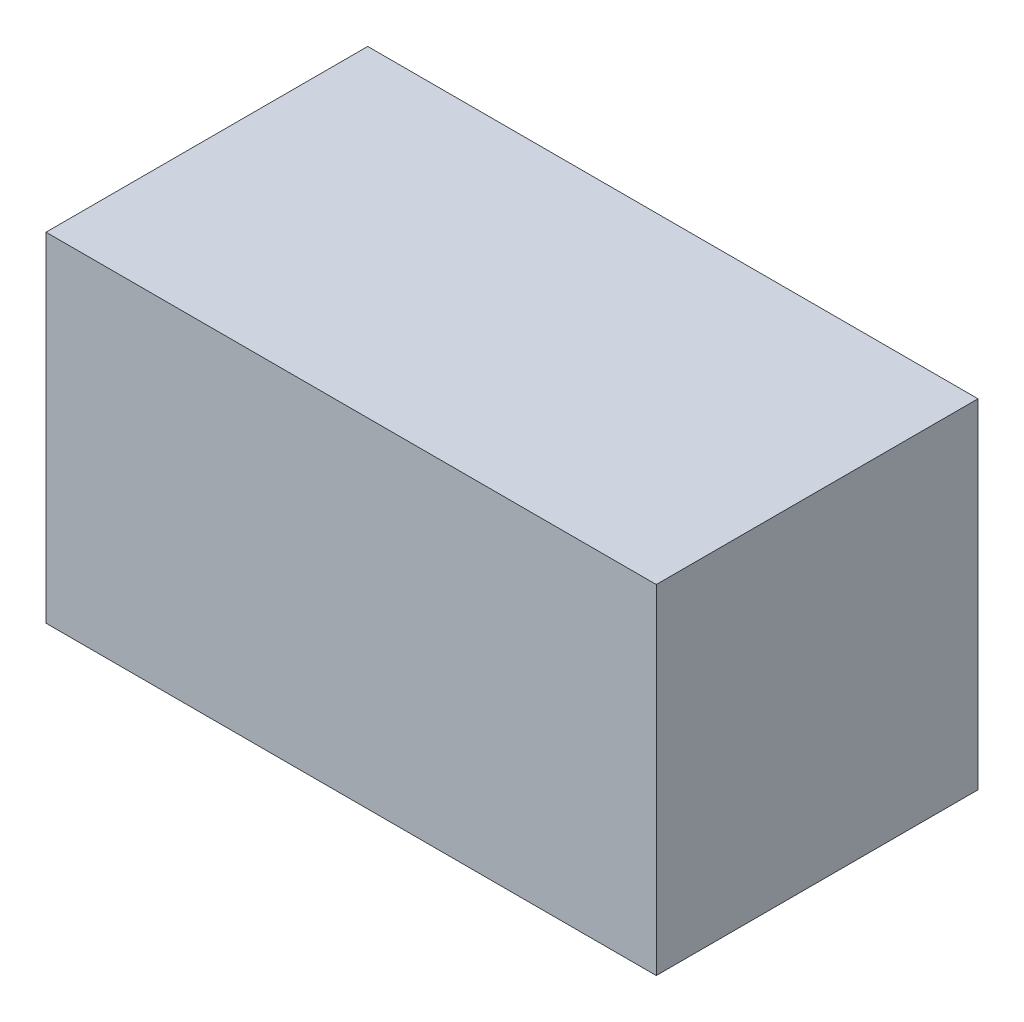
ISO-10303-21;
HEADER;
FILE_DESCRIPTION(('STEP AP214'),'2;1');
FILE_NAME('part.step','',(''),(''),'','','');
FILE_SCHEMA(('AUTOMOTIVE_DESIGN { 1 0 10303 214 1 1 1 1 }'));
ENDSEC;
DATA;
#1=APPLICATION_CONTEXT('core data for automotive mechanical design processes');
#2=APPLICATION_PROTOCOL_DEFINITION('international standard','automotive_design',2000,#1);
#3=PRODUCT_CONTEXT('',#1,'mechanical');
#4=PRODUCT('Part','Part','',(#3));
#5=PRODUCT_RELATED_PRODUCT_CATEGORY('part','',(#4));
#6=PRODUCT_DEFINITION_FORMATION('','',#4);
#7=PRODUCT_DEFINITION_CONTEXT('part definition',#1,'design');
#8=PRODUCT_DEFINITION('design','',#6,#7);
#9=PRODUCT_DEFINITION_SHAPE('','',#8);
#10=(LENGTH_UNIT() NAMED_UNIT(*) SI_UNIT(.MILLI.,.METRE.));
#11=(NAMED_UNIT(*) PLANE_ANGLE_UNIT() SI_UNIT($,.RADIAN.));
#12=(NAMED_UNIT(*) SI_UNIT($,.STERADIAN.) SOLID_ANGLE_UNIT());
#13=UNCERTAINTY_MEASURE_WITH_UNIT(LENGTH_MEASURE(1.E-05),#10,'distance_accuracy_value','');
#14=(GEOMETRIC_REPRESENTATION_CONTEXT(3) GLOBAL_UNCERTAINTY_ASSIGNED_CONTEXT((#13)) GLOBAL_UNIT_ASSIGNED_CONTEXT((#10,
#11,#12)) REPRESENTATION_CONTEXT('',''));
#15=CARTESIAN_POINT('',(0.,0.,0.));
#16=DIRECTION('',(0.,0.,1.));
#17=DIRECTION('',(1.,0.,0.));
#18=AXIS2_PLACEMENT_3D('',#15,#16,#17);
#19=CARTESIAN_POINT('',(0.,10.,0.));
#20=DIRECTION('',(1.,0.,0.));
#21=DIRECTION('',(0.,0.,-1.));
#22=AXIS2_PLACEMENT_3D('',#19,#20,#21);
#23=PLANE('',#22);
#24=DIRECTION('',(0.,0.,1.));
#25=VECTOR('',#24,1.);
#26=CARTESIAN_POINT('',(0.,0.,0.));
#27=LINE('',#26,#25);
#28=CARTESIAN_POINT('',(0.,0.,0.));
#29=VERTEX_POINT('',#28);
#30=CARTESIAN_POINT('',(0.,0.,9.5));
#31=VERTEX_POINT('',#30);
#32=EDGE_CURVE('E112',#29,#31,#27,.T.);
#33=ORIENTED_EDGE('',*,*,#32,.T.);
#34=DIRECTION('',(0.,-1.,0.));
#35=VECTOR('',#34,1.);
#36=CARTESIAN_POINT('',(0.,10.,9.5));
#37=LINE('',#36,#35);
#38=CARTESIAN_POINT('',(0.,10.,9.5));
#39=VERTEX_POINT('',#38);
#40=EDGE_CURVE('E11',#39,#31,#37,.T.);
#41=ORIENTED_EDGE('',*,*,#40,.F.);
#42=DIRECTION('',(0.,0.,1.));
#43=VECTOR('',#42,1.);
#44=CARTESIAN_POINT('',(0.,10.,0.));
#45=LINE('',#44,#43);
#46=CARTESIAN_POINT('',(0.,10.,0.));
#47=VERTEX_POINT('',#46);
#48=EDGE_CURVE('E96',#47,#39,#45,.T.);
#49=ORIENTED_EDGE('',*,*,#48,.F.);
#50=DIRECTION('',(0.,-1.,0.));
#51=VECTOR('',#50,1.);
#52=CARTESIAN_POINT('',(0.,10.,0.));
#53=LINE('',#52,#51);
#54=EDGE_CURVE('E108',#47,#29,#53,.T.);
#55=ORIENTED_EDGE('',*,*,#54,.T.);
#56=EDGE_LOOP('',(#33,#41,#49,#55));
#57=FACE_BOUND('',#56,.T.);
#58=ADVANCED_FACE('F44',(#57),#23,.F.);
#59=CARTESIAN_POINT('',(0.,10.,9.5));
#60=DIRECTION('',(0.,0.,-1.));
#61=DIRECTION('',(-1.,0.,0.));
#62=AXIS2_PLACEMENT_3D('',#59,#60,#61);
#63=PLANE('',#62);
#64=DIRECTION('',(1.,0.,0.));
#65=VECTOR('',#64,1.);
#66=CARTESIAN_POINT('',(0.,0.,9.5));
#67=LINE('',#66,#65);
#68=CARTESIAN_POINT('',(18.02,0.,9.5));
#69=VERTEX_POINT('',#68);
#70=EDGE_CURVE('E101',#31,#69,#67,.T.);
#71=ORIENTED_EDGE('',*,*,#70,.T.);
#72=DIRECTION('',(0.,-1.,0.));
#73=VECTOR('',#72,1.);
#74=CARTESIAN_POINT('',(18.02,10.,9.5));
#75=LINE('',#74,#73);
#76=CARTESIAN_POINT('',(18.02,10.,9.5));
#77=VERTEX_POINT('',#76);
#78=EDGE_CURVE('E53',#77,#69,#75,.T.);
#79=ORIENTED_EDGE('',*,*,#78,.F.);
#80=DIRECTION('',(1.,0.,0.));
#81=VECTOR('',#80,1.);
#82=CARTESIAN_POINT('',(0.,10.,9.5));
#83=LINE('',#82,#81);
#84=EDGE_CURVE('E91',#39,#77,#83,.T.);
#85=ORIENTED_EDGE('',*,*,#84,.F.);
#86=ORIENTED_EDGE('',*,*,#40,.T.);
#87=EDGE_LOOP('',(#71,#79,#85,#86));
#88=FACE_BOUND('',#87,.T.);
#89=ADVANCED_FACE('F100',(#88),#63,.F.);
#90=CARTESIAN_POINT('',(18.02,10.,0.));
#91=DIRECTION('',(-1.,0.,0.));
#92=DIRECTION('',(0.,0.,1.));
#93=AXIS2_PLACEMENT_3D('',#90,#91,#92);
#94=PLANE('',#93);
#95=DIRECTION('',(0.,0.,-1.));
#96=VECTOR('',#95,1.);
#97=CARTESIAN_POINT('',(18.02,0.,0.));
#98=LINE('',#97,#96);
#99=CARTESIAN_POINT('',(18.02,0.,0.));
#100=VERTEX_POINT('',#99);
#101=EDGE_CURVE('E78',#69,#100,#98,.T.);
#102=ORIENTED_EDGE('',*,*,#101,.T.);
#103=DIRECTION('',(0.,-1.,0.));
#104=VECTOR('',#103,1.);
#105=CARTESIAN_POINT('',(18.02,10.,0.));
#106=LINE('',#105,#104);
#107=CARTESIAN_POINT('',(18.02,10.,0.));
#108=VERTEX_POINT('',#107);
#109=EDGE_CURVE('E103',#108,#100,#106,.T.);
#110=ORIENTED_EDGE('',*,*,#109,.F.);
#111=DIRECTION('',(0.,0.,-1.));
#112=VECTOR('',#111,1.);
#113=CARTESIAN_POINT('',(18.02,10.,0.));
#114=LINE('',#113,#112);
#115=EDGE_CURVE('E94',#77,#108,#114,.T.);
#116=ORIENTED_EDGE('',*,*,#115,.F.);
#117=ORIENTED_EDGE('',*,*,#78,.T.);
#118=EDGE_LOOP('',(#102,#110,#116,#117));
#119=FACE_BOUND('',#118,.T.);
#120=ADVANCED_FACE('F104',(#119),#94,.F.);
#121=CARTESIAN_POINT('',(0.,10.,0.));
#122=DIRECTION('',(0.,0.,1.));
#123=DIRECTION('',(1.,0.,0.));
#124=AXIS2_PLACEMENT_3D('',#121,#122,#123);
#125=PLANE('',#124);
#126=DIRECTION('',(-1.,0.,0.));
#127=VECTOR('',#126,1.);
#128=CARTESIAN_POINT('',(0.,0.,0.));
#129=LINE('',#128,#127);
#130=EDGE_CURVE('E84',#100,#29,#129,.T.);
#131=ORIENTED_EDGE('',*,*,#130,.T.);
#132=ORIENTED_EDGE('',*,*,#54,.F.);
#133=DIRECTION('',(-1.,0.,0.));
#134=VECTOR('',#133,1.);
#135=CARTESIAN_POINT('',(0.,10.,0.));
#136=LINE('',#135,#134);
#137=EDGE_CURVE('E61',#108,#47,#136,.T.);
#138=ORIENTED_EDGE('',*,*,#137,.F.);
#139=ORIENTED_EDGE('',*,*,#109,.T.);
#140=EDGE_LOOP('',(#131,#132,#138,#139));
#141=FACE_BOUND('',#140,.T.);
#142=ADVANCED_FACE('F125',(#141),#125,.F.);
#143=CARTESIAN_POINT('',(0.,10.,0.));
#144=DIRECTION('',(0.,1.,0.));
#145=DIRECTION('',(0.,0.,1.));
#146=AXIS2_PLACEMENT_3D('',#143,#144,#145);
#147=PLANE('',#146);
#148=ORIENTED_EDGE('',*,*,#48,.T.);
#149=ORIENTED_EDGE('',*,*,#84,.T.);
#150=ORIENTED_EDGE('',*,*,#115,.T.);
#151=ORIENTED_EDGE('',*,*,#137,.T.);
#152=EDGE_LOOP('',(#148,#149,#150,#151));
#153=FACE_BOUND('',#152,.T.);
#154=ADVANCED_FACE('F92',(#153),#147,.T.);
#155=CARTESIAN_POINT('',(0.,0.,0.));
#156=DIRECTION('',(0.,1.,0.));
#157=DIRECTION('',(0.,0.,1.));
#158=AXIS2_PLACEMENT_3D('',#155,#156,#157);
#159=PLANE('',#158);
#160=ORIENTED_EDGE('',*,*,#32,.F.);
#161=ORIENTED_EDGE('',*,*,#130,.F.);
#162=ORIENTED_EDGE('',*,*,#101,.F.);
#163=ORIENTED_EDGE('',*,*,#70,.F.);
#164=EDGE_LOOP('',(#160,#161,#162,#163));
#165=FACE_BOUND('',#164,.T.);
#166=ADVANCED_FACE('F128',(#165),#159,.F.);
#167=CLOSED_SHELL('',(#58,#89,#120,#142,#154,#166));
#168=MANIFOLD_SOLID_BREP('B2',#167);
#169=ADVANCED_BREP_SHAPE_REPRESENTATION('',(#18,#168),#14);
#170=SHAPE_DEFINITION_REPRESENTATION(#9,#169);
ENDSEC;
END-ISO-10303-21;
